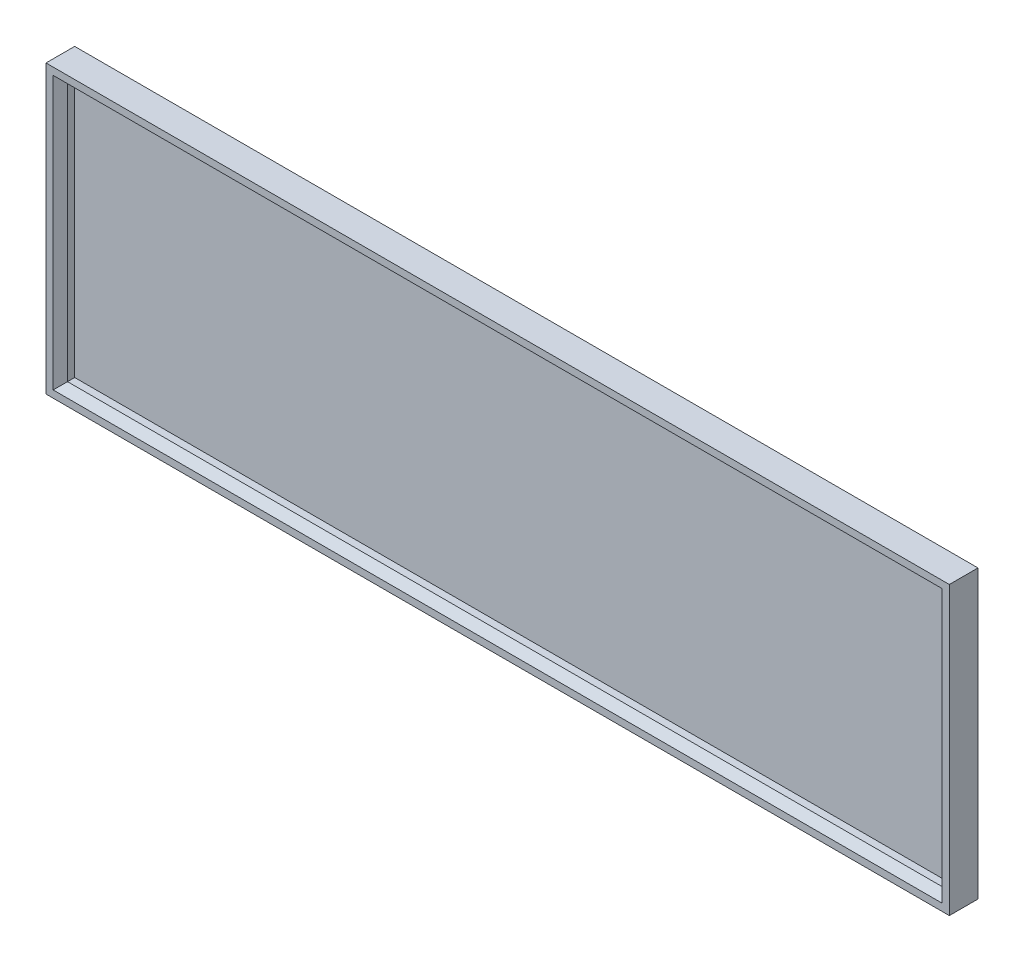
ISO-10303-21;
HEADER;
FILE_DESCRIPTION(('STEP AP214'),'2;1');
FILE_NAME('part.step','',(''),(''),'','','');
FILE_SCHEMA(('AUTOMOTIVE_DESIGN { 1 0 10303 214 1 1 1 1 }'));
ENDSEC;
DATA;
#1=APPLICATION_CONTEXT('core data for automotive mechanical design processes');
#2=APPLICATION_PROTOCOL_DEFINITION('international standard','automotive_design',2000,#1);
#3=PRODUCT_CONTEXT('',#1,'mechanical');
#4=PRODUCT('Part','Part','',(#3));
#5=PRODUCT_RELATED_PRODUCT_CATEGORY('part','',(#4));
#6=PRODUCT_DEFINITION_FORMATION('','',#4);
#7=PRODUCT_DEFINITION_CONTEXT('part definition',#1,'design');
#8=PRODUCT_DEFINITION('design','',#6,#7);
#9=PRODUCT_DEFINITION_SHAPE('','',#8);
#10=(LENGTH_UNIT() NAMED_UNIT(*) SI_UNIT(.MILLI.,.METRE.));
#11=(NAMED_UNIT(*) PLANE_ANGLE_UNIT() SI_UNIT($,.RADIAN.));
#12=(NAMED_UNIT(*) SI_UNIT($,.STERADIAN.) SOLID_ANGLE_UNIT());
#13=UNCERTAINTY_MEASURE_WITH_UNIT(LENGTH_MEASURE(1.E-05),#10,'distance_accuracy_value','');
#14=(GEOMETRIC_REPRESENTATION_CONTEXT(3) GLOBAL_UNCERTAINTY_ASSIGNED_CONTEXT((#13)) GLOBAL_UNIT_ASSIGNED_CONTEXT((#10,
#11,#12)) REPRESENTATION_CONTEXT('',''));
#15=CARTESIAN_POINT('',(0.,0.,0.));
#16=DIRECTION('',(0.,0.,1.));
#17=DIRECTION('',(1.,0.,0.));
#18=AXIS2_PLACEMENT_3D('',#15,#16,#17);
#19=CARTESIAN_POINT('',(0.,0.,20.));
#20=DIRECTION('',(1.,0.,0.));
#21=DIRECTION('',(0.,1.,0.));
#22=AXIS2_PLACEMENT_3D('',#19,#20,#21);
#23=PLANE('',#22);
#24=DIRECTION('',(0.,-1.,0.));
#25=VECTOR('',#24,1.);
#26=CARTESIAN_POINT('',(0.,0.,0.));
#27=LINE('',#26,#25);
#28=CARTESIAN_POINT('',(0.,0.,0.));
#29=VERTEX_POINT('',#28);
#30=CARTESIAN_POINT('',(0.,-200.,0.));
#31=VERTEX_POINT('',#30);
#32=EDGE_CURVE('E179',#29,#31,#27,.T.);
#33=ORIENTED_EDGE('',*,*,#32,.T.);
#34=DIRECTION('',(0.,0.,-1.));
#35=VECTOR('',#34,1.);
#36=CARTESIAN_POINT('',(0.,-200.,20.));
#37=LINE('',#36,#35);
#38=CARTESIAN_POINT('',(0.,-200.,20.));
#39=VERTEX_POINT('',#38);
#40=EDGE_CURVE('E220',#39,#31,#37,.T.);
#41=ORIENTED_EDGE('',*,*,#40,.F.);
#42=DIRECTION('',(0.,-1.,0.));
#43=VECTOR('',#42,1.);
#44=CARTESIAN_POINT('',(0.,0.,20.));
#45=LINE('',#44,#43);
#46=CARTESIAN_POINT('',(0.,0.,20.));
#47=VERTEX_POINT('',#46);
#48=EDGE_CURVE('E194',#47,#39,#45,.T.);
#49=ORIENTED_EDGE('',*,*,#48,.F.);
#50=DIRECTION('',(0.,0.,-1.));
#51=VECTOR('',#50,1.);
#52=CARTESIAN_POINT('',(0.,0.,20.));
#53=LINE('',#52,#51);
#54=EDGE_CURVE('E204',#47,#29,#53,.T.);
#55=ORIENTED_EDGE('',*,*,#54,.T.);
#56=EDGE_LOOP('',(#33,#41,#49,#55));
#57=FACE_BOUND('',#56,.T.);
#58=ADVANCED_FACE('F31',(#57),#23,.F.);
#59=CARTESIAN_POINT('',(0.,-200.,20.));
#60=DIRECTION('',(0.,1.,0.));
#61=DIRECTION('',(0.,0.,1.));
#62=AXIS2_PLACEMENT_3D('',#59,#60,#61);
#63=PLANE('',#62);
#64=DIRECTION('',(1.,0.,0.));
#65=VECTOR('',#64,1.);
#66=CARTESIAN_POINT('',(0.,-200.,0.));
#67=LINE('',#66,#65);
#68=CARTESIAN_POINT('',(630.,-200.,0.));
#69=VERTEX_POINT('',#68);
#70=EDGE_CURVE('E207',#31,#69,#67,.T.);
#71=ORIENTED_EDGE('',*,*,#70,.T.);
#72=DIRECTION('',(0.,0.,-1.));
#73=VECTOR('',#72,1.);
#74=CARTESIAN_POINT('',(630.,-200.,20.));
#75=LINE('',#74,#73);
#76=CARTESIAN_POINT('',(630.,-200.,20.));
#77=VERTEX_POINT('',#76);
#78=EDGE_CURVE('E217',#77,#69,#75,.T.);
#79=ORIENTED_EDGE('',*,*,#78,.F.);
#80=DIRECTION('',(1.,0.,0.));
#81=VECTOR('',#80,1.);
#82=CARTESIAN_POINT('',(0.,-200.,20.));
#83=LINE('',#82,#81);
#84=EDGE_CURVE('E197',#39,#77,#83,.T.);
#85=ORIENTED_EDGE('',*,*,#84,.F.);
#86=ORIENTED_EDGE('',*,*,#40,.T.);
#87=EDGE_LOOP('',(#71,#79,#85,#86));
#88=FACE_BOUND('',#87,.T.);
#89=ADVANCED_FACE('F286',(#88),#63,.F.);
#90=CARTESIAN_POINT('',(630.,0.,20.));
#91=DIRECTION('',(-1.,0.,0.));
#92=DIRECTION('',(0.,0.,1.));
#93=AXIS2_PLACEMENT_3D('',#90,#91,#92);
#94=PLANE('',#93);
#95=DIRECTION('',(0.,1.,0.));
#96=VECTOR('',#95,1.);
#97=CARTESIAN_POINT('',(630.,0.,0.));
#98=LINE('',#97,#96);
#99=CARTESIAN_POINT('',(630.,0.,0.));
#100=VERTEX_POINT('',#99);
#101=EDGE_CURVE('E209',#69,#100,#98,.T.);
#102=ORIENTED_EDGE('',*,*,#101,.T.);
#103=DIRECTION('',(0.,0.,-1.));
#104=VECTOR('',#103,1.);
#105=CARTESIAN_POINT('',(630.,0.,20.));
#106=LINE('',#105,#104);
#107=CARTESIAN_POINT('',(630.,0.,20.));
#108=VERTEX_POINT('',#107);
#109=EDGE_CURVE('E214',#108,#100,#106,.T.);
#110=ORIENTED_EDGE('',*,*,#109,.F.);
#111=DIRECTION('',(0.,1.,0.));
#112=VECTOR('',#111,1.);
#113=CARTESIAN_POINT('',(630.,0.,20.));
#114=LINE('',#113,#112);
#115=EDGE_CURVE('E200',#77,#108,#114,.T.);
#116=ORIENTED_EDGE('',*,*,#115,.F.);
#117=ORIENTED_EDGE('',*,*,#78,.T.);
#118=EDGE_LOOP('',(#102,#110,#116,#117));
#119=FACE_BOUND('',#118,.T.);
#120=ADVANCED_FACE('F292',(#119),#94,.F.);
#121=CARTESIAN_POINT('',(0.,0.,20.));
#122=DIRECTION('',(0.,-1.,0.));
#123=DIRECTION('',(0.,0.,-1.));
#124=AXIS2_PLACEMENT_3D('',#121,#122,#123);
#125=PLANE('',#124);
#126=DIRECTION('',(-1.,0.,0.));
#127=VECTOR('',#126,1.);
#128=CARTESIAN_POINT('',(0.,0.,0.));
#129=LINE('',#128,#127);
#130=EDGE_CURVE('E198',#100,#29,#129,.T.);
#131=ORIENTED_EDGE('',*,*,#130,.T.);
#132=ORIENTED_EDGE('',*,*,#54,.F.);
#133=DIRECTION('',(-1.,0.,0.));
#134=VECTOR('',#133,1.);
#135=CARTESIAN_POINT('',(0.,0.,20.));
#136=LINE('',#135,#134);
#137=EDGE_CURVE('E202',#108,#47,#136,.T.);
#138=ORIENTED_EDGE('',*,*,#137,.F.);
#139=ORIENTED_EDGE('',*,*,#109,.T.);
#140=EDGE_LOOP('',(#131,#132,#138,#139));
#141=FACE_BOUND('',#140,.T.);
#142=ADVANCED_FACE('F353',(#141),#125,.F.);
#143=CARTESIAN_POINT('',(0.,-200.,20.));
#144=DIRECTION('',(0.,0.,1.));
#145=DIRECTION('',(1.,0.,0.));
#146=AXIS2_PLACEMENT_3D('',#143,#144,#145);
#147=PLANE('',#146);
#148=DIRECTION('',(0.,-1.,0.));
#149=VECTOR('',#148,1.);
#150=CARTESIAN_POINT('',(625.,-200.,20.));
#151=LINE('',#150,#149);
#152=CARTESIAN_POINT('',(625.,-5.00000000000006,20.));
#153=VERTEX_POINT('',#152);
#154=CARTESIAN_POINT('',(625.,-195.,20.));
#155=VERTEX_POINT('',#154);
#156=EDGE_CURVE('E230',#153,#155,#151,.T.);
#157=ORIENTED_EDGE('',*,*,#156,.T.);
#158=DIRECTION('',(-1.,0.,0.));
#159=VECTOR('',#158,1.);
#160=CARTESIAN_POINT('',(0.,-195.,20.));
#161=LINE('',#160,#159);
#162=CARTESIAN_POINT('',(5.00000000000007,-195.,20.));
#163=VERTEX_POINT('',#162);
#164=EDGE_CURVE('E232',#155,#163,#161,.T.);
#165=ORIENTED_EDGE('',*,*,#164,.T.);
#166=DIRECTION('',(0.,1.,0.));
#167=VECTOR('',#166,1.);
#168=CARTESIAN_POINT('',(5.00000000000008,-200.,20.));
#169=LINE('',#168,#167);
#170=CARTESIAN_POINT('',(5.00000000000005,-5.00000000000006,20.));
#171=VERTEX_POINT('',#170);
#172=EDGE_CURVE('E228',#163,#171,#169,.T.);
#173=ORIENTED_EDGE('',*,*,#172,.T.);
#174=DIRECTION('',(1.,0.,0.));
#175=VECTOR('',#174,1.);
#176=CARTESIAN_POINT('',(0.,-5.00000000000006,20.));
#177=LINE('',#176,#175);
#178=EDGE_CURVE('E226',#171,#153,#177,.T.);
#179=ORIENTED_EDGE('',*,*,#178,.T.);
#180=EDGE_LOOP('',(#157,#165,#173,#179));
#181=FACE_BOUND('',#180,.T.);
#182=ORIENTED_EDGE('',*,*,#48,.T.);
#183=ORIENTED_EDGE('',*,*,#84,.T.);
#184=ORIENTED_EDGE('',*,*,#115,.T.);
#185=ORIENTED_EDGE('',*,*,#137,.T.);
#186=EDGE_LOOP('',(#182,#183,#184,#185));
#187=FACE_BOUND('',#186,.T.);
#188=ADVANCED_FACE('F255',(#181,#187),#147,.T.);
#189=CARTESIAN_POINT('',(0.,-200.,0.));
#190=DIRECTION('',(0.,0.,1.));
#191=DIRECTION('',(1.,0.,0.));
#192=AXIS2_PLACEMENT_3D('',#189,#190,#191);
#193=PLANE('',#192);
#194=DIRECTION('',(-1.,0.,0.));
#195=VECTOR('',#194,1.);
#196=CARTESIAN_POINT('',(0.,-10.,0.));
#197=LINE('',#196,#195);
#198=CARTESIAN_POINT('',(620.,-10.,0.));
#199=VERTEX_POINT('',#198);
#200=CARTESIAN_POINT('',(10.,-10.,0.));
#201=VERTEX_POINT('',#200);
#202=EDGE_CURVE('E138',#199,#201,#197,.T.);
#203=ORIENTED_EDGE('',*,*,#202,.T.);
#204=DIRECTION('',(0.,-1.,0.));
#205=VECTOR('',#204,1.);
#206=CARTESIAN_POINT('',(10.,0.,0.));
#207=LINE('',#206,#205);
#208=CARTESIAN_POINT('',(10.,-190.,0.));
#209=VERTEX_POINT('',#208);
#210=EDGE_CURVE('E147',#201,#209,#207,.T.);
#211=ORIENTED_EDGE('',*,*,#210,.T.);
#212=DIRECTION('',(1.,0.,0.));
#213=VECTOR('',#212,1.);
#214=CARTESIAN_POINT('',(0.,-190.,0.));
#215=LINE('',#214,#213);
#216=CARTESIAN_POINT('',(620.,-190.,0.));
#217=VERTEX_POINT('',#216);
#218=EDGE_CURVE('E154',#209,#217,#215,.T.);
#219=ORIENTED_EDGE('',*,*,#218,.T.);
#220=DIRECTION('',(0.,1.,0.));
#221=VECTOR('',#220,1.);
#222=CARTESIAN_POINT('',(620.,0.,0.));
#223=LINE('',#222,#221);
#224=EDGE_CURVE('E158',#217,#199,#223,.T.);
#225=ORIENTED_EDGE('',*,*,#224,.T.);
#226=EDGE_LOOP('',(#203,#211,#219,#225));
#227=FACE_BOUND('',#226,.T.);
#228=ORIENTED_EDGE('',*,*,#32,.F.);
#229=ORIENTED_EDGE('',*,*,#130,.F.);
#230=ORIENTED_EDGE('',*,*,#101,.F.);
#231=ORIENTED_EDGE('',*,*,#70,.F.);
#232=EDGE_LOOP('',(#228,#229,#230,#231));
#233=FACE_BOUND('',#232,.T.);
#234=ADVANCED_FACE('F156',(#227,#233),#193,.F.);
#235=CARTESIAN_POINT('',(10.,0.,20.));
#236=DIRECTION('',(1.,0.,0.));
#237=DIRECTION('',(0.,1.,0.));
#238=AXIS2_PLACEMENT_3D('',#235,#236,#237);
#239=PLANE('',#238);
#240=DIRECTION('',(0.,0.,-1.));
#241=VECTOR('',#240,1.);
#242=CARTESIAN_POINT('',(10.,-10.,20.));
#243=LINE('',#242,#241);
#244=CARTESIAN_POINT('',(10.,-10.,15.0000000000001));
#245=VERTEX_POINT('',#244);
#246=CARTESIAN_POINT('',(10.,-10.,10.));
#247=VERTEX_POINT('',#246);
#248=EDGE_CURVE('E181',#245,#247,#243,.T.);
#249=ORIENTED_EDGE('',*,*,#248,.F.);
#250=DIRECTION('',(0.,-1.,0.));
#251=VECTOR('',#250,1.);
#252=CARTESIAN_POINT('',(10.,0.,15.0000000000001));
#253=LINE('',#252,#251);
#254=CARTESIAN_POINT('',(10.,-190.,15.0000000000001));
#255=VERTEX_POINT('',#254);
#256=EDGE_CURVE('E40',#245,#255,#253,.T.);
#257=ORIENTED_EDGE('',*,*,#256,.T.);
#258=DIRECTION('',(0.,0.,-1.));
#259=VECTOR('',#258,1.);
#260=CARTESIAN_POINT('',(10.,-190.,20.));
#261=LINE('',#260,#259);
#262=CARTESIAN_POINT('',(10.,-190.,10.));
#263=VERTEX_POINT('',#262);
#264=EDGE_CURVE('E177',#255,#263,#261,.T.);
#265=ORIENTED_EDGE('',*,*,#264,.T.);
#266=DIRECTION('',(0.,-1.,0.));
#267=VECTOR('',#266,1.);
#268=CARTESIAN_POINT('',(10.,0.,10.));
#269=LINE('',#268,#267);
#270=EDGE_CURVE('E173',#247,#263,#269,.T.);
#271=ORIENTED_EDGE('',*,*,#270,.F.);
#272=EDGE_LOOP('',(#249,#257,#265,#271));
#273=FACE_BOUND('',#272,.T.);
#274=ADVANCED_FACE('F275',(#273),#239,.T.);
#275=CARTESIAN_POINT('',(0.,-190.,20.));
#276=DIRECTION('',(0.,1.,0.));
#277=DIRECTION('',(0.,0.,1.));
#278=AXIS2_PLACEMENT_3D('',#275,#276,#277);
#279=PLANE('',#278);
#280=ORIENTED_EDGE('',*,*,#264,.F.);
#281=DIRECTION('',(1.,0.,0.));
#282=VECTOR('',#281,1.);
#283=CARTESIAN_POINT('',(0.,-190.,15.0000000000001));
#284=LINE('',#283,#282);
#285=CARTESIAN_POINT('',(620.,-190.,15.0000000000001));
#286=VERTEX_POINT('',#285);
#287=EDGE_CURVE('E223',#255,#286,#284,.T.);
#288=ORIENTED_EDGE('',*,*,#287,.T.);
#289=DIRECTION('',(0.,0.,-1.));
#290=VECTOR('',#289,1.);
#291=CARTESIAN_POINT('',(620.,-190.,20.));
#292=LINE('',#291,#290);
#293=CARTESIAN_POINT('',(620.,-190.,10.));
#294=VERTEX_POINT('',#293);
#295=EDGE_CURVE('E180',#286,#294,#292,.T.);
#296=ORIENTED_EDGE('',*,*,#295,.T.);
#297=DIRECTION('',(1.,0.,0.));
#298=VECTOR('',#297,1.);
#299=CARTESIAN_POINT('',(0.,-190.,10.));
#300=LINE('',#299,#298);
#301=EDGE_CURVE('E176',#263,#294,#300,.T.);
#302=ORIENTED_EDGE('',*,*,#301,.F.);
#303=EDGE_LOOP('',(#280,#288,#296,#302));
#304=FACE_BOUND('',#303,.T.);
#305=ADVANCED_FACE('F265',(#304),#279,.T.);
#306=CARTESIAN_POINT('',(620.,0.,20.));
#307=DIRECTION('',(-1.,0.,0.));
#308=DIRECTION('',(0.,0.,1.));
#309=AXIS2_PLACEMENT_3D('',#306,#307,#308);
#310=PLANE('',#309);
#311=ORIENTED_EDGE('',*,*,#295,.F.);
#312=DIRECTION('',(0.,1.,0.));
#313=VECTOR('',#312,1.);
#314=CARTESIAN_POINT('',(620.,0.,15.0000000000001));
#315=LINE('',#314,#313);
#316=CARTESIAN_POINT('',(620.,-10.,15.0000000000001));
#317=VERTEX_POINT('',#316);
#318=EDGE_CURVE('E54',#286,#317,#315,.T.);
#319=ORIENTED_EDGE('',*,*,#318,.T.);
#320=DIRECTION('',(0.,0.,-1.));
#321=VECTOR('',#320,1.);
#322=CARTESIAN_POINT('',(620.,-10.,20.));
#323=LINE('',#322,#321);
#324=CARTESIAN_POINT('',(620.,-10.,10.));
#325=VERTEX_POINT('',#324);
#326=EDGE_CURVE('E183',#317,#325,#323,.T.);
#327=ORIENTED_EDGE('',*,*,#326,.T.);
#328=DIRECTION('',(0.,1.,0.));
#329=VECTOR('',#328,1.);
#330=CARTESIAN_POINT('',(620.,0.,10.));
#331=LINE('',#330,#329);
#332=EDGE_CURVE('E187',#294,#325,#331,.T.);
#333=ORIENTED_EDGE('',*,*,#332,.F.);
#334=EDGE_LOOP('',(#311,#319,#327,#333));
#335=FACE_BOUND('',#334,.T.);
#336=ADVANCED_FACE('F268',(#335),#310,.T.);
#337=CARTESIAN_POINT('',(0.,-10.,20.));
#338=DIRECTION('',(0.,-1.,0.));
#339=DIRECTION('',(0.,0.,-1.));
#340=AXIS2_PLACEMENT_3D('',#337,#338,#339);
#341=PLANE('',#340);
#342=ORIENTED_EDGE('',*,*,#326,.F.);
#343=DIRECTION('',(-1.,0.,0.));
#344=VECTOR('',#343,1.);
#345=CARTESIAN_POINT('',(0.,-10.,15.0000000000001));
#346=LINE('',#345,#344);
#347=EDGE_CURVE('E11',#317,#245,#346,.T.);
#348=ORIENTED_EDGE('',*,*,#347,.T.);
#349=ORIENTED_EDGE('',*,*,#248,.T.);
#350=DIRECTION('',(-1.,0.,0.));
#351=VECTOR('',#350,1.);
#352=CARTESIAN_POINT('',(0.,-10.,10.));
#353=LINE('',#352,#351);
#354=EDGE_CURVE('E184',#325,#247,#353,.T.);
#355=ORIENTED_EDGE('',*,*,#354,.F.);
#356=EDGE_LOOP('',(#342,#348,#349,#355));
#357=FACE_BOUND('',#356,.T.);
#358=ADVANCED_FACE('F273',(#357),#341,.T.);
#359=CARTESIAN_POINT('',(0.,-200.,10.));
#360=DIRECTION('',(0.,0.,1.));
#361=DIRECTION('',(1.,0.,0.));
#362=AXIS2_PLACEMENT_3D('',#359,#360,#361);
#363=PLANE('',#362);
#364=ORIENTED_EDGE('',*,*,#270,.T.);
#365=ORIENTED_EDGE('',*,*,#301,.T.);
#366=ORIENTED_EDGE('',*,*,#332,.T.);
#367=ORIENTED_EDGE('',*,*,#354,.T.);
#368=EDGE_LOOP('',(#364,#365,#366,#367));
#369=FACE_BOUND('',#368,.T.);
#370=ADVANCED_FACE('F271',(#369),#363,.T.);
#371=CARTESIAN_POINT('',(0.,-200.,2.));
#372=DIRECTION('',(0.,0.,1.));
#373=DIRECTION('',(1.,0.,0.));
#374=AXIS2_PLACEMENT_3D('',#371,#372,#373);
#375=PLANE('',#374);
#376=DIRECTION('',(0.,1.,0.));
#377=VECTOR('',#376,1.);
#378=CARTESIAN_POINT('',(620.,0.,2.));
#379=LINE('',#378,#377);
#380=CARTESIAN_POINT('',(620.,-190.,2.));
#381=VERTEX_POINT('',#380);
#382=CARTESIAN_POINT('',(620.,-10.,2.));
#383=VERTEX_POINT('',#382);
#384=EDGE_CURVE('E169',#381,#383,#379,.T.);
#385=ORIENTED_EDGE('',*,*,#384,.F.);
#386=DIRECTION('',(1.,0.,0.));
#387=VECTOR('',#386,1.);
#388=CARTESIAN_POINT('',(0.,-190.,2.));
#389=LINE('',#388,#387);
#390=CARTESIAN_POINT('',(10.,-190.,2.));
#391=VERTEX_POINT('',#390);
#392=EDGE_CURVE('E166',#391,#381,#389,.T.);
#393=ORIENTED_EDGE('',*,*,#392,.F.);
#394=DIRECTION('',(0.,-1.,0.));
#395=VECTOR('',#394,1.);
#396=CARTESIAN_POINT('',(10.,0.,2.));
#397=LINE('',#396,#395);
#398=CARTESIAN_POINT('',(10.,-10.,2.));
#399=VERTEX_POINT('',#398);
#400=EDGE_CURVE('E164',#399,#391,#397,.T.);
#401=ORIENTED_EDGE('',*,*,#400,.F.);
#402=DIRECTION('',(-1.,0.,0.));
#403=VECTOR('',#402,1.);
#404=CARTESIAN_POINT('',(0.,-10.,2.));
#405=LINE('',#404,#403);
#406=EDGE_CURVE('E140',#383,#399,#405,.T.);
#407=ORIENTED_EDGE('',*,*,#406,.F.);
#408=EDGE_LOOP('',(#385,#393,#401,#407));
#409=FACE_BOUND('',#408,.T.);
#410=ADVANCED_FACE('F316',(#409),#375,.F.);
#411=CARTESIAN_POINT('',(10.,0.,20.));
#412=DIRECTION('',(1.,0.,0.));
#413=DIRECTION('',(0.,1.,0.));
#414=AXIS2_PLACEMENT_3D('',#411,#412,#413);
#415=PLANE('',#414);
#416=ORIENTED_EDGE('',*,*,#400,.T.);
#417=DIRECTION('',(0.,0.,-1.));
#418=VECTOR('',#417,1.);
#419=CARTESIAN_POINT('',(10.,-190.,20.));
#420=LINE('',#419,#418);
#421=EDGE_CURVE('E150',#391,#209,#420,.T.);
#422=ORIENTED_EDGE('',*,*,#421,.T.);
#423=ORIENTED_EDGE('',*,*,#210,.F.);
#424=DIRECTION('',(0.,0.,-1.));
#425=VECTOR('',#424,1.);
#426=CARTESIAN_POINT('',(10.,-10.,20.));
#427=LINE('',#426,#425);
#428=EDGE_CURVE('E133',#399,#201,#427,.T.);
#429=ORIENTED_EDGE('',*,*,#428,.F.);
#430=EDGE_LOOP('',(#416,#422,#423,#429));
#431=FACE_BOUND('',#430,.T.);
#432=ADVANCED_FACE('F148',(#431),#415,.T.);
#433=CARTESIAN_POINT('',(0.,-190.,20.));
#434=DIRECTION('',(0.,1.,0.));
#435=DIRECTION('',(0.,0.,1.));
#436=AXIS2_PLACEMENT_3D('',#433,#434,#435);
#437=PLANE('',#436);
#438=ORIENTED_EDGE('',*,*,#392,.T.);
#439=DIRECTION('',(0.,0.,-1.));
#440=VECTOR('',#439,1.);
#441=CARTESIAN_POINT('',(620.,-190.,20.));
#442=LINE('',#441,#440);
#443=EDGE_CURVE('E328',#381,#217,#442,.T.);
#444=ORIENTED_EDGE('',*,*,#443,.T.);
#445=ORIENTED_EDGE('',*,*,#218,.F.);
#446=ORIENTED_EDGE('',*,*,#421,.F.);
#447=EDGE_LOOP('',(#438,#444,#445,#446));
#448=FACE_BOUND('',#447,.T.);
#449=ADVANCED_FACE('F312',(#448),#437,.T.);
#450=CARTESIAN_POINT('',(620.,0.,20.));
#451=DIRECTION('',(-1.,0.,0.));
#452=DIRECTION('',(0.,0.,1.));
#453=AXIS2_PLACEMENT_3D('',#450,#451,#452);
#454=PLANE('',#453);
#455=ORIENTED_EDGE('',*,*,#384,.T.);
#456=DIRECTION('',(0.,0.,-1.));
#457=VECTOR('',#456,1.);
#458=CARTESIAN_POINT('',(620.,-10.,20.));
#459=LINE('',#458,#457);
#460=EDGE_CURVE('E144',#383,#199,#459,.T.);
#461=ORIENTED_EDGE('',*,*,#460,.T.);
#462=ORIENTED_EDGE('',*,*,#224,.F.);
#463=ORIENTED_EDGE('',*,*,#443,.F.);
#464=EDGE_LOOP('',(#455,#461,#462,#463));
#465=FACE_BOUND('',#464,.T.);
#466=ADVANCED_FACE('F307',(#465),#454,.T.);
#467=CARTESIAN_POINT('',(0.,-10.,20.));
#468=DIRECTION('',(0.,-1.,0.));
#469=DIRECTION('',(0.,0.,-1.));
#470=AXIS2_PLACEMENT_3D('',#467,#468,#469);
#471=PLANE('',#470);
#472=ORIENTED_EDGE('',*,*,#406,.T.);
#473=ORIENTED_EDGE('',*,*,#428,.T.);
#474=ORIENTED_EDGE('',*,*,#202,.F.);
#475=ORIENTED_EDGE('',*,*,#460,.F.);
#476=EDGE_LOOP('',(#472,#473,#474,#475));
#477=FACE_BOUND('',#476,.T.);
#478=ADVANCED_FACE('F135',(#477),#471,.T.);
#479=CARTESIAN_POINT('',(0.,-10.,15.0000000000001));
#480=DIRECTION('',(0.,0.707106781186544,-0.707106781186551));
#481=DIRECTION('',(0.,0.707106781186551,0.707106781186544));
#482=AXIS2_PLACEMENT_3D('',#479,#480,#481);
#483=PLANE('',#482);
#484=DIRECTION('',(0.577350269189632,0.577350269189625,0.57735026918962));
#485=VECTOR('',#484,1.);
#486=CARTESIAN_POINT('',(623.333333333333,-6.66666666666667,18.3333333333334));
#487=LINE('',#486,#485);
#488=EDGE_CURVE('E240',#153,#317,#487,.F.);
#489=ORIENTED_EDGE('',*,*,#488,.F.);
#490=ORIENTED_EDGE('',*,*,#178,.F.);
#491=DIRECTION('',(0.577350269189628,-0.577350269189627,-0.577350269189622));
#492=VECTOR('',#491,1.);
#493=CARTESIAN_POINT('',(6.66666666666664,-6.66666666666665,18.3333333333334));
#494=LINE('',#493,#492);
#495=EDGE_CURVE('E35',#245,#171,#494,.F.);
#496=ORIENTED_EDGE('',*,*,#495,.F.);
#497=ORIENTED_EDGE('',*,*,#347,.F.);
#498=EDGE_LOOP('',(#489,#490,#496,#497));
#499=FACE_BOUND('',#498,.T.);
#500=ADVANCED_FACE('F33',(#499),#483,.F.);
#501=CARTESIAN_POINT('',(10.,0.,15.0000000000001));
#502=DIRECTION('',(-0.707106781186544,0.,-0.707106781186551));
#503=DIRECTION('',(-0.707106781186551,0.,0.707106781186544));
#504=AXIS2_PLACEMENT_3D('',#501,#502,#503);
#505=PLANE('',#504);
#506=ORIENTED_EDGE('',*,*,#495,.T.);
#507=ORIENTED_EDGE('',*,*,#172,.F.);
#508=DIRECTION('',(0.577350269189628,0.577350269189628,-0.577350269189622));
#509=VECTOR('',#508,1.);
#510=CARTESIAN_POINT('',(6.66666666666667,-193.333333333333,18.3333333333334));
#511=LINE('',#510,#509);
#512=EDGE_CURVE('E239',#255,#163,#511,.F.);
#513=ORIENTED_EDGE('',*,*,#512,.F.);
#514=ORIENTED_EDGE('',*,*,#256,.F.);
#515=EDGE_LOOP('',(#506,#507,#513,#514));
#516=FACE_BOUND('',#515,.T.);
#517=ADVANCED_FACE('F250',(#516),#505,.F.);
#518=CARTESIAN_POINT('',(620.,0.,15.0000000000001));
#519=DIRECTION('',(0.70710678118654,0.,-0.707106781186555));
#520=DIRECTION('',(-0.707106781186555,0.,-0.70710678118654));
#521=AXIS2_PLACEMENT_3D('',#518,#519,#520);
#522=PLANE('',#521);
#523=ORIENTED_EDGE('',*,*,#488,.T.);
#524=ORIENTED_EDGE('',*,*,#318,.F.);
#525=DIRECTION('',(0.577350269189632,-0.577350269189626,0.577350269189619));
#526=VECTOR('',#525,1.);
#527=CARTESIAN_POINT('',(413.333333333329,16.6666666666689,-191.666666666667));
#528=LINE('',#527,#526);
#529=EDGE_CURVE('E237',#155,#286,#528,.F.);
#530=ORIENTED_EDGE('',*,*,#529,.F.);
#531=ORIENTED_EDGE('',*,*,#156,.F.);
#532=EDGE_LOOP('',(#523,#524,#530,#531));
#533=FACE_BOUND('',#532,.T.);
#534=ADVANCED_FACE('F262',(#533),#522,.F.);
#535=CARTESIAN_POINT('',(0.,-190.,15.0000000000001));
#536=DIRECTION('',(0.,-0.707106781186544,-0.707106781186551));
#537=DIRECTION('',(0.,0.707106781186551,-0.707106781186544));
#538=AXIS2_PLACEMENT_3D('',#535,#536,#537);
#539=PLANE('',#538);
#540=ORIENTED_EDGE('',*,*,#512,.T.);
#541=ORIENTED_EDGE('',*,*,#164,.F.);
#542=ORIENTED_EDGE('',*,*,#529,.T.);
#543=ORIENTED_EDGE('',*,*,#287,.F.);
#544=EDGE_LOOP('',(#540,#541,#542,#543));
#545=FACE_BOUND('',#544,.T.);
#546=ADVANCED_FACE('F260',(#545),#539,.F.);
#547=CLOSED_SHELL('',(#58,#89,#120,#142,#188,#234,#274,#305,#336,#358,#370,#410,#432,#449,#466,
#478,#500,#517,#534,#546));
#548=MANIFOLD_SOLID_BREP('B2',#547);
#549=ADVANCED_BREP_SHAPE_REPRESENTATION('',(#18,#548),#14);
#550=SHAPE_DEFINITION_REPRESENTATION(#9,#549);
ENDSEC;
END-ISO-10303-21;
